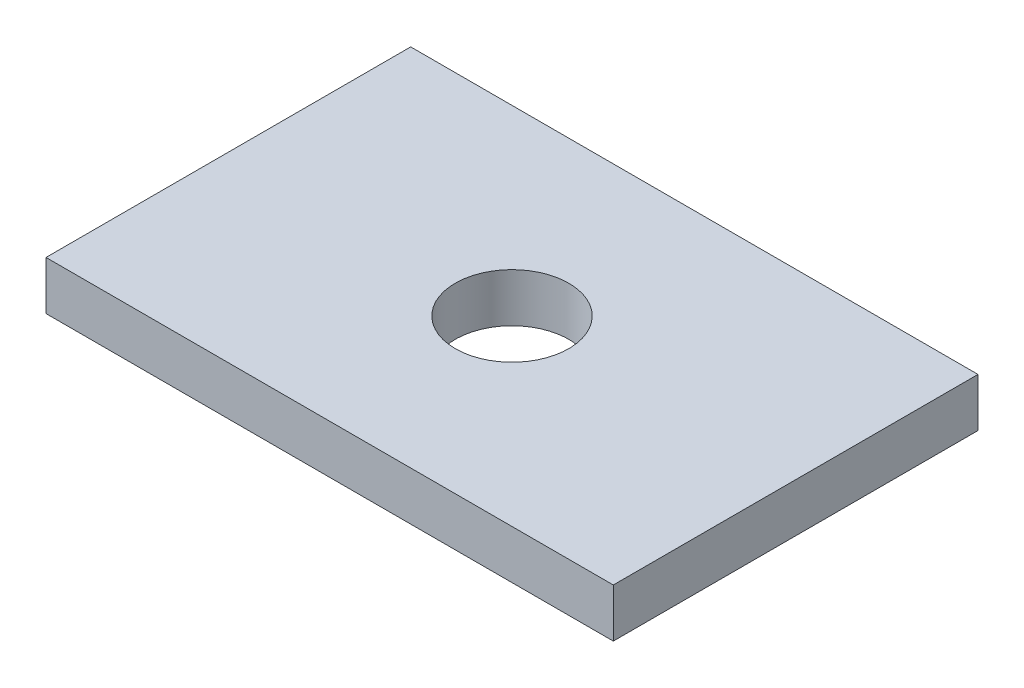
from build123d import *

# Parameters (mm, degrees)
SKETCH_1_W          = 140
SKETCH_1_H          = 90
EXTRUDE_1_DEPTH     = 12
SKETCH_2_R          = 14
CUT_EXTRUDE_1_DEPTH = 12


with BuildPart() as part:
    # Sketch 1 → Extrude 1 (new body)
    with BuildSketch(Plane(origin=(0, 0, 0), x_dir=(1, 0, 0), z_dir=(0, 1, 0))):
        with Locations((70, 45)):
            Rectangle(SKETCH_1_W, SKETCH_1_H)
    extrude(amount=-EXTRUDE_1_DEPTH)

    # Sketch 2 → Cut-Extrude 1 (cut)
    with BuildSketch(Plane(origin=(0, 0, 0), x_dir=(1, 0, 0), z_dir=(0, 1, 0))):
        with Locations(Location((70, 45, 0), (0, 0, 270))):
            Circle(SKETCH_2_R)
    extrude(amount=-CUT_EXTRUDE_1_DEPTH, mode=Mode.SUBTRACT)


solid = part.part
